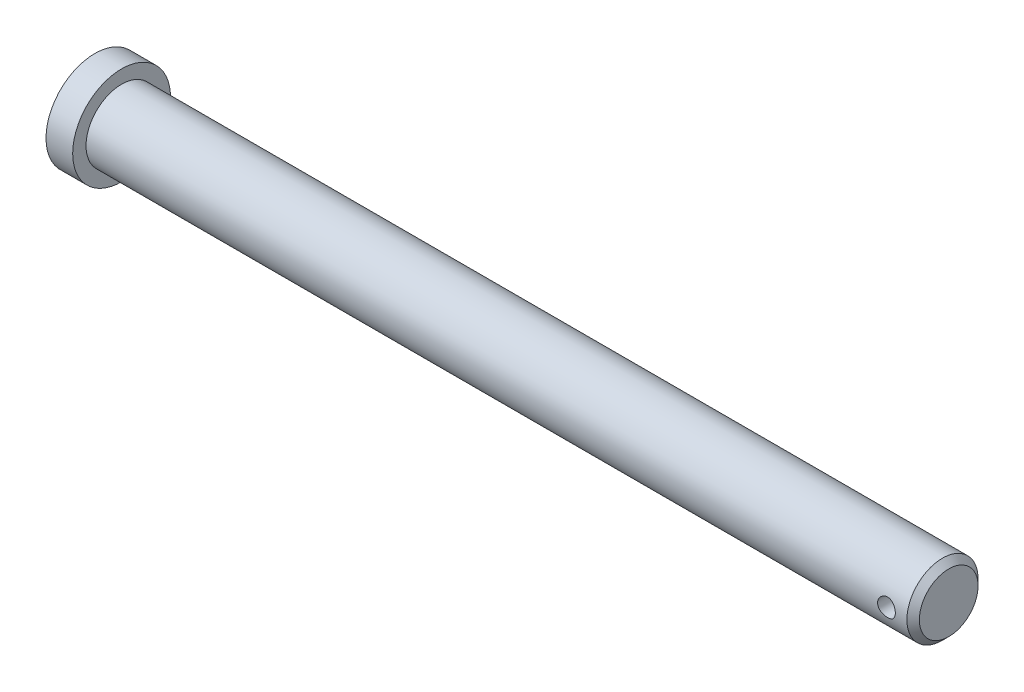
from build123d import *

# Parameters (mm, degrees)
CUT_EXTRUDE_1_DEPTH      = 97.314588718
CUT_EXTRUDE_1_DEPTH_BACK = 97.314588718
SKETCH_2_R               = 1
CHAMFER_1_SIZE           = 0.7


with BuildPart() as part:
    # Sketch 1 → Revolve 4 (revolve)
    with BuildSketch(Plane.XY, mode=Mode.PRIVATE) as revolve_4_sk:
        Polygon((0, 0), (0, 4), (-93, 4), (-93, 5.5), (-96, 5.5), (-96, 0), align=None)
    revolve(revolve_4_sk.sketch.rotate(Axis((-96, 0, 0), (1, 0, 0)), 90), axis=Axis((-96, 0, 0), (1, 0, 0)))

    # Sketch 2 → Cut-Extrude 1 (cut, two sides: drawn at the far end of the back side and taken through both)
    with BuildSketch(Plane.XY.offset(-CUT_EXTRUDE_1_DEPTH_BACK)):
        with Locations((-3, 0)):
            Circle(SKETCH_2_R)
    extrude(amount=CUT_EXTRUDE_1_DEPTH + CUT_EXTRUDE_1_DEPTH_BACK, mode=Mode.SUBTRACT)

    # Chamfer 1
    chamfer_1_edges = [part.edges().sort_by_distance(p)[0] for p in [
        (0, 0, -4),
    ]]
    chamfer(chamfer_1_edges, length=CHAMFER_1_SIZE)


solid = part.part
